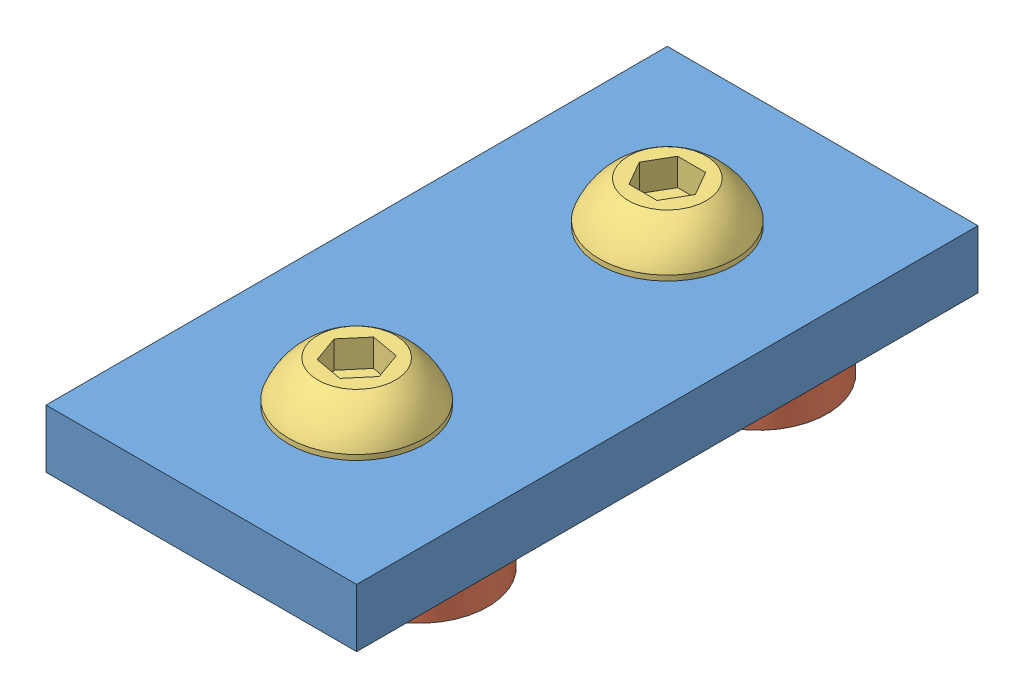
SolidWorks assembly 80-20 Straight Degree Bracket Assy.SLDASM, configuration Default (file format 10000). Lengths in mm.
Overall size (27.4 16.05 50.8).
5 component instances, 3 part files, 8 mates.
Components (placement in the parent):
- 80-20 Straight Bracket-1: 80-20 Straight Bracket.SLDPRT [Default] at (0.8462 27.7915 64.7631) size (25.4 4.76 50.8)
- 80-20 0.25-20 T-NUT-1: 80-20 0.25-20 T-NUT.SLDPRT [Default] at (-97.753 25.3785 158.8711) x (0.998508 0 -0.054607) z (0 1 0) size (25.4 11.25 2.41)
- 0.25-20 Button Head Cap Screw (BHCS)-1: 0.25-20 Button Head Cap Screw (BHCS).SLDPRT [Default] at (13.5462 35.9068 26.6631) x (1 0 0) z (0 -1 0) size (11.1 11.1 16.05)
- 0.25-20 Button Head Cap Screw (BHCS)-2: 0.25-20 Button Head Cap Screw (BHCS).SLDPRT [Default] at (13.5462 35.9068 52.0631) x (-0.336886 0 -0.941545) z (0 -1 0) size (11.1 11.1 16.05)
- 80-20 0.25-20 T-NUT-2: 80-20 0.25-20 T-NUT.SLDPRT [Default] at (159.4049 25.3785 -40.6283) x (-0.968835 0 -0.247709) z (0 1 0) size (25.4 11.25 2.41)
Mates (geometry in assembly coordinates):
- Concentric1: concentric anti-aligned: cylinder of 80-20 Straight Bracket-1 through (13.5462 32.554 52.0631) axis (0 -1 0) radius 3.3782; cylinder of 0.25-20 Button Head Cap Screw (BHCS)-2 through (13.5462 19.854 52.0631) axis (0 1 0) radius 3.175
- Concentric2: concentric anti-aligned: cylinder of 80-20 Straight Bracket-1 through (13.5462 32.554 26.6631) axis (0 -1 0) radius 3.3782; cylinder of 0.25-20 Button Head Cap Screw (BHCS)-1 through (13.5462 19.854 26.6631) axis (0 1 0) radius 3.175
- Concentric3: concentric anti-aligned: cylinder of 80-20 Straight Bracket-1 through (13.5462 32.554 52.0631) axis (0 -1 0) radius 3.3782; cylinder of 80-20 0.25-20 T-NUT-2 through (13.5462 25.3775 52.0631) axis (0 1 0) radius 3.175
- Concentric4: concentric anti-aligned: cylinder of 80-20 Straight Bracket-1 through (13.5462 32.554 26.6631) axis (0 -1 0) radius 3.3782; cylinder of 80-20 0.25-20 T-NUT-1 through (13.5462 25.3775 26.6631) axis (0 1 0) radius 3.175
- Coincident1: coincident anti-aligned: plane of 80-20 Straight Bracket-1 through (0.8462 27.7915 64.7631) normal (0 -1 0); plane of 80-20 0.25-20 T-NUT-2 through (20.3996 27.7915 53.8154) normal (0 1 0)
- Coincident2: coincident anti-aligned: plane of 80-20 Straight Bracket-1 through (0.8462 27.7915 64.7631) normal (0 -1 0); plane of 80-20 0.25-20 T-NUT-1 through (6.4828 27.7915 27.0494) normal (0 1 0)
- Coincident3: coincident anti-aligned: plane of 80-20 Straight Bracket-1 through (0.8462 32.554 64.7631) normal (0 1 0); plane of 0.25-20 Button Head Cap Screw (BHCS)-2 through (11.6765 32.554 46.8376) normal (0 -1 0)
- Coincident4: coincident anti-aligned: plane of 80-20 Straight Bracket-1 through (0.8462 32.554 64.7631) normal (0 1 0); plane of 0.25-20 Button Head Cap Screw (BHCS)-1 through (19.0961 32.554 26.6631) normal (0 -1 0)
